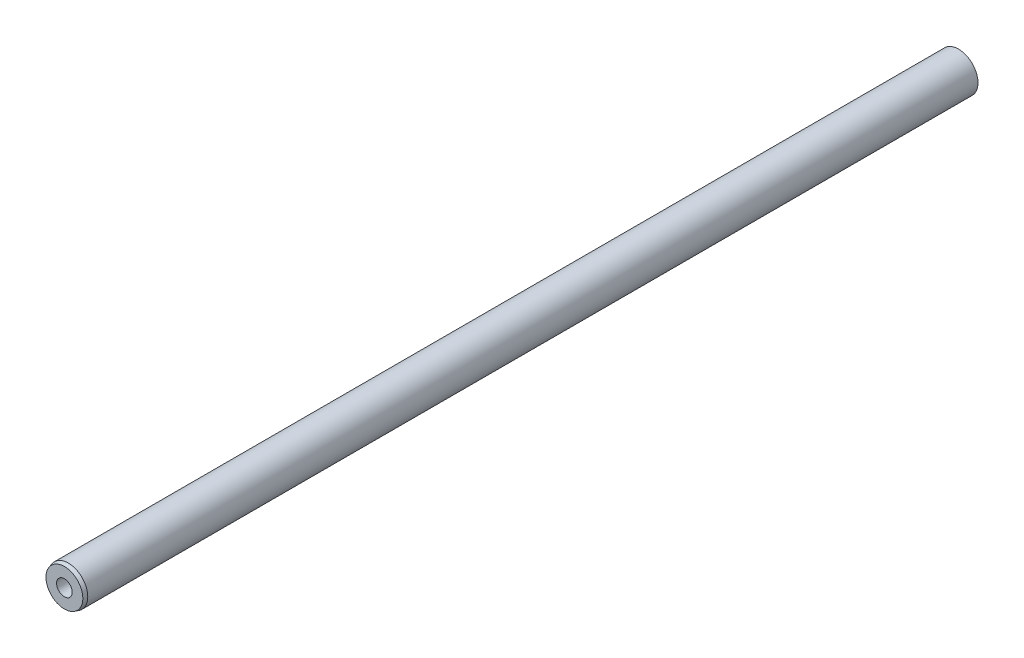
from build123d import *

# Parameters (mm, degrees)
SKETCH1_R          = 6.35
BASE_EXTRUDE_DEPTH = 291.4904
CHAMFER1_SIZE      = 1.27
CHAMFER1_SIZE2     = 0.340295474


with BuildPart() as part:
    # Sketch1 → Base-Extrude (new body)
    with BuildSketch(Plane.XY):
        Circle(SKETCH1_R)
    extrude(amount=BASE_EXTRUDE_DEPTH)

    # Chamfer1
    chamfer1_edges = [part.edges().sort_by_distance(p)[0] for p in [
        (-6.35, 0, 291.4904),
    ]]
    chamfer1_side = [part.faces().sort_by_distance(p)[0] for p in [
        (-6.35, 0, 145.7452),
    ]]
    chamfer(chamfer1_edges, length=CHAMFER1_SIZE, length2=CHAMFER1_SIZE2, reference=chamfer1_side[0])

    # Sketch5 → 1_4-20 Tapped Hole1 (revolve, cut)
    with BuildSketch(Plane(origin=(0, 0, 291.4904), x_dir=(0, -1, 0), z_dir=(1, 0, 0))):
        Polygon((0, 0), (0, 14.233804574), (2.552697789, 12.699989), (2.552697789, 0.002539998), (2.552697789, 0), align=None)
    revolve(axis=Axis((0, 0, 297.8404), (0, 0, -1)), mode=Mode.SUBTRACT)


solid = part.part
